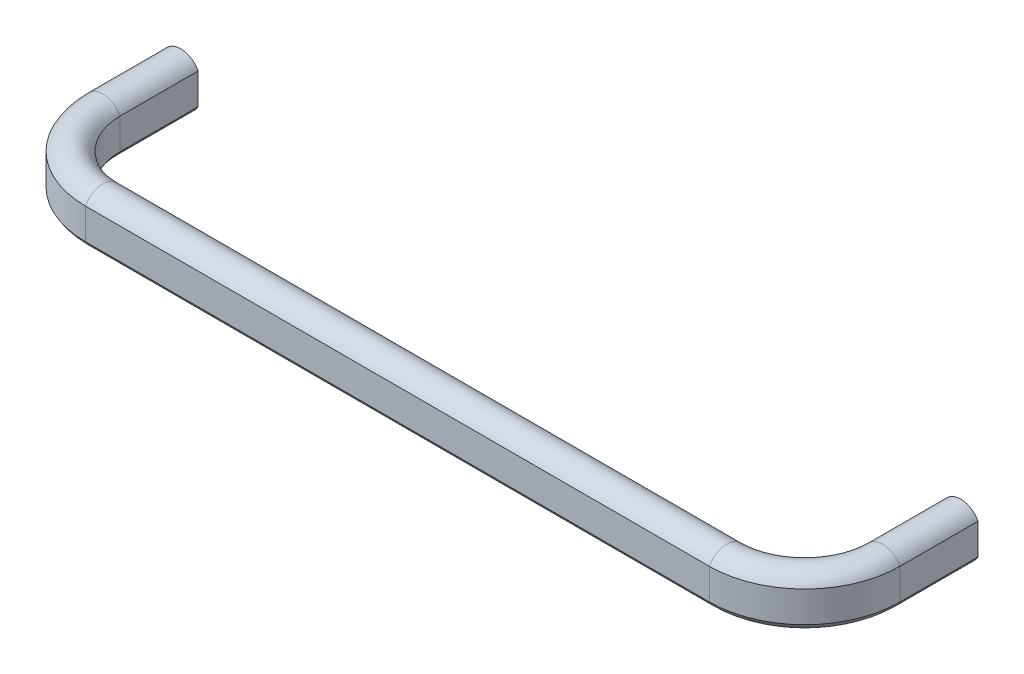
ISO-10303-21;
HEADER;
FILE_DESCRIPTION(('STEP AP214'),'2;1');
FILE_NAME('part.step','',(''),(''),'','','');
FILE_SCHEMA(('AUTOMOTIVE_DESIGN { 1 0 10303 214 1 1 1 1 }'));
ENDSEC;
DATA;
#1=APPLICATION_CONTEXT('core data for automotive mechanical design processes');
#2=APPLICATION_PROTOCOL_DEFINITION('international standard','automotive_design',2000,#1);
#3=PRODUCT_CONTEXT('',#1,'mechanical');
#4=PRODUCT('Part','Part','',(#3));
#5=PRODUCT_RELATED_PRODUCT_CATEGORY('part','',(#4));
#6=PRODUCT_DEFINITION_FORMATION('','',#4);
#7=PRODUCT_DEFINITION_CONTEXT('part definition',#1,'design');
#8=PRODUCT_DEFINITION('design','',#6,#7);
#9=PRODUCT_DEFINITION_SHAPE('','',#8);
#10=(LENGTH_UNIT() NAMED_UNIT(*) SI_UNIT(.MILLI.,.METRE.));
#11=(NAMED_UNIT(*) PLANE_ANGLE_UNIT() SI_UNIT($,.RADIAN.));
#12=(NAMED_UNIT(*) SI_UNIT($,.STERADIAN.) SOLID_ANGLE_UNIT());
#13=UNCERTAINTY_MEASURE_WITH_UNIT(LENGTH_MEASURE(1.E-05),#10,'distance_accuracy_value','');
#14=(GEOMETRIC_REPRESENTATION_CONTEXT(3) GLOBAL_UNCERTAINTY_ASSIGNED_CONTEXT((#13)) GLOBAL_UNIT_ASSIGNED_CONTEXT((#10,
#11,#12)) REPRESENTATION_CONTEXT('',''));
#15=CARTESIAN_POINT('',(0.,0.,0.));
#16=DIRECTION('',(0.,0.,1.));
#17=DIRECTION('',(1.,0.,0.));
#18=AXIS2_PLACEMENT_3D('',#15,#16,#17);
#19=CARTESIAN_POINT('',(179.999999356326,1.50000021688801,0.));
#20=DIRECTION('',(0.,0.,1.));
#21=DIRECTION('',(0.,1.,0.));
#22=AXIS2_PLACEMENT_3D('',#19,#20,#21);
#23=PLANE('',#22);
#24=CARTESIAN_POINT('',(180.,0.,0.));
#25=DIRECTION('',(0.,0.,1.));
#26=DIRECTION('',(1.,0.,0.));
#27=AXIS2_PLACEMENT_3D('',#24,#25,#26);
#28=CIRCLE('',#27,2.95000000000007);
#29=CARTESIAN_POINT('',(182.95,0.,0.));
#30=VERTEX_POINT('',#29);
#31=EDGE_CURVE('E9',#30,#30,#28,.T.);
#32=ORIENTED_EDGE('',*,*,#31,.T.);
#33=EDGE_LOOP('',(#32));
#34=FACE_BOUND('',#33,.T.);
#35=CARTESIAN_POINT('',(179.999999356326,1.50000021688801,0.));
#36=DIRECTION('',(0.,0.,1.));
#37=DIRECTION('',(0.,1.,0.));
#38=AXIS2_PLACEMENT_3D('',#35,#36,#37);
#39=CIRCLE('',#38,4.50000072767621);
#40=CARTESIAN_POINT('',(184.000000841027,3.56155173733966,0.));
#41=VERTEX_POINT('',#40);
#42=CARTESIAN_POINT('',(175.999999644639,3.56155517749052,0.));
#43=VERTEX_POINT('',#42);
#44=EDGE_CURVE('E209',#41,#43,#39,.T.);
#45=ORIENTED_EDGE('',*,*,#44,.F.);
#46=DIRECTION('',(-2.36140868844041E-07,-0.999999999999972,0.));
#47=VECTOR('',#46,1.);
#48=CARTESIAN_POINT('',(184.000000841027,3.56155173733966,0.));
#49=LINE('',#48,#47);
#50=CARTESIAN_POINT('',(183.999999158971,-3.56155311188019,0.));
#51=VERTEX_POINT('',#50);
#52=EDGE_CURVE('E30',#41,#51,#49,.T.);
#53=ORIENTED_EDGE('',*,*,#52,.T.);
#54=CARTESIAN_POINT('',(179.99999767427,-1.50000159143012,0.));
#55=DIRECTION('',(0.,0.,1.));
#56=DIRECTION('',(0.,1.,0.));
#57=AXIS2_PLACEMENT_3D('',#54,#55,#56);
#58=CIRCLE('',#57,4.49999811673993);
#59=CARTESIAN_POINT('',(176.000000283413,-3.56155535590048,0.));
#60=VERTEX_POINT('',#59);
#61=EDGE_CURVE('E38',#60,#51,#58,.T.);
#62=ORIENTED_EDGE('',*,*,#61,.F.);
#63=DIRECTION('',(-2.36140868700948E-07,-0.999999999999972,0.));
#64=VECTOR('',#63,1.);
#65=CARTESIAN_POINT('',(175.999999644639,3.56155517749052,0.));
#66=LINE('',#65,#64);
#67=EDGE_CURVE('E230',#43,#60,#66,.T.);
#68=ORIENTED_EDGE('',*,*,#67,.F.);
#69=EDGE_LOOP('',(#45,#53,#62,#68));
#70=FACE_BOUND('',#69,.T.);
#71=ADVANCED_FACE('F14',(#34,#70),#23,.F.);
#72=CARTESIAN_POINT('',(6.43673064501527E-07,1.50000021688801,0.));
#73=DIRECTION('',(0.,0.,-1.));
#74=DIRECTION('',(0.,1.,0.));
#75=AXIS2_PLACEMENT_3D('',#72,#73,#74);
#76=PLANE('',#75);
#77=CARTESIAN_POINT('',(0.,0.,0.));
#78=DIRECTION('',(0.,0.,-1.));
#79=DIRECTION('',(-1.,0.,0.));
#80=AXIS2_PLACEMENT_3D('',#77,#78,#79);
#81=CIRCLE('',#80,2.95);
#82=CARTESIAN_POINT('',(-2.95,0.,0.));
#83=VERTEX_POINT('',#82);
#84=EDGE_CURVE('E236',#83,#83,#81,.F.);
#85=ORIENTED_EDGE('',*,*,#84,.T.);
#86=EDGE_LOOP('',(#85));
#87=FACE_BOUND('',#86,.T.);
#88=CARTESIAN_POINT('',(6.43673064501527E-07,1.50000021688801,0.));
#89=DIRECTION('',(0.,0.,-1.));
#90=DIRECTION('',(0.,1.,0.));
#91=AXIS2_PLACEMENT_3D('',#88,#89,#90);
#92=CIRCLE('',#91,4.50000072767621);
#93=CARTESIAN_POINT('',(-4.00000084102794,3.56155173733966,0.));
#94=VERTEX_POINT('',#93);
#95=CARTESIAN_POINT('',(4.00000035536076,3.56155517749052,0.));
#96=VERTEX_POINT('',#95);
#97=EDGE_CURVE('E107',#94,#96,#92,.T.);
#98=ORIENTED_EDGE('',*,*,#97,.T.);
#99=DIRECTION('',(2.36140868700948E-07,-0.999999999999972,0.));
#100=VECTOR('',#99,1.);
#101=CARTESIAN_POINT('',(4.00000035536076,3.56155517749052,0.));
#102=LINE('',#101,#100);
#103=CARTESIAN_POINT('',(3.99999971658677,-3.56155535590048,0.));
#104=VERTEX_POINT('',#103);
#105=EDGE_CURVE('E111',#96,#104,#102,.T.);
#106=ORIENTED_EDGE('',*,*,#105,.T.);
#107=CARTESIAN_POINT('',(2.32573006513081E-06,-1.50000159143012,0.));
#108=DIRECTION('',(0.,0.,-1.));
#109=DIRECTION('',(0.,1.,0.));
#110=AXIS2_PLACEMENT_3D('',#107,#108,#109);
#111=CIRCLE('',#110,4.49999811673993);
#112=CARTESIAN_POINT('',(-3.99999915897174,-3.56155311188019,0.));
#113=VERTEX_POINT('',#112);
#114=EDGE_CURVE('E132',#104,#113,#111,.T.);
#115=ORIENTED_EDGE('',*,*,#114,.T.);
#116=DIRECTION('',(2.36140868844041E-07,-0.999999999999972,0.));
#117=VECTOR('',#116,1.);
#118=CARTESIAN_POINT('',(-4.00000084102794,3.56155173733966,0.));
#119=LINE('',#118,#117);
#120=EDGE_CURVE('E114',#94,#113,#119,.T.);
#121=ORIENTED_EDGE('',*,*,#120,.F.);
#122=EDGE_LOOP('',(#98,#106,#115,#121));
#123=FACE_BOUND('',#122,.T.);
#124=ADVANCED_FACE('F109',(#87,#123),#76,.T.);
#125=CARTESIAN_POINT('',(184.000000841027,3.56155173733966,18.));
#126=DIRECTION('',(0.999999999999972,-2.36140868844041E-07,0.));
#127=DIRECTION('',(2.36140868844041E-07,0.999999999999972,0.));
#128=AXIS2_PLACEMENT_3D('',#125,#126,#127);
#129=PLANE('',#128);
#130=DIRECTION('',(-2.36140868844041E-07,-0.999999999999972,0.));
#131=VECTOR('',#130,1.);
#132=CARTESIAN_POINT('',(184.000000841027,3.56155173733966,18.));
#133=LINE('',#132,#131);
#134=CARTESIAN_POINT('',(184.000000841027,3.56155173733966,18.));
#135=VERTEX_POINT('',#134);
#136=CARTESIAN_POINT('',(183.999999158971,-3.56155311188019,18.));
#137=VERTEX_POINT('',#136);
#138=EDGE_CURVE('E200',#135,#137,#133,.T.);
#139=ORIENTED_EDGE('',*,*,#138,.T.);
#140=DIRECTION('',(0.,0.,-1.));
#141=VECTOR('',#140,1.);
#142=CARTESIAN_POINT('',(183.999999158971,-3.56155311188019,18.));
#143=LINE('',#142,#141);
#144=EDGE_CURVE('E223',#137,#51,#143,.T.);
#145=ORIENTED_EDGE('',*,*,#144,.T.);
#146=ORIENTED_EDGE('',*,*,#52,.F.);
#147=DIRECTION('',(0.,0.,-1.));
#148=VECTOR('',#147,1.);
#149=CARTESIAN_POINT('',(184.000000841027,3.56155173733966,18.));
#150=LINE('',#149,#148);
#151=EDGE_CURVE('E225',#135,#41,#150,.T.);
#152=ORIENTED_EDGE('',*,*,#151,.F.);
#153=EDGE_LOOP('',(#139,#145,#146,#152));
#154=FACE_BOUND('',#153,.T.);
#155=ADVANCED_FACE('F262',(#154),#129,.T.);
#156=CARTESIAN_POINT('',(179.99999767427,-1.50000159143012,18.));
#157=DIRECTION('',(0.,0.,-1.));
#158=DIRECTION('',(1.,0.,0.));
#159=AXIS2_PLACEMENT_3D('',#156,#157,#158);
#160=CYLINDRICAL_SURFACE('',#159,4.49999811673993);
#161=CARTESIAN_POINT('',(179.99999767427,-1.50000159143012,18.));
#162=DIRECTION('',(0.,0.,1.));
#163=DIRECTION('',(0.,1.,0.));
#164=AXIS2_PLACEMENT_3D('',#161,#162,#163);
#165=CIRCLE('',#164,4.49999811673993);
#166=CARTESIAN_POINT('',(176.000000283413,-3.56155535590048,18.));
#167=VERTEX_POINT('',#166);
#168=EDGE_CURVE('E214',#167,#137,#165,.T.);
#169=ORIENTED_EDGE('',*,*,#168,.F.);
#170=DIRECTION('',(0.,0.,-1.));
#171=VECTOR('',#170,1.);
#172=CARTESIAN_POINT('',(176.000000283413,-3.56155535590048,18.));
#173=LINE('',#172,#171);
#174=EDGE_CURVE('E221',#167,#60,#173,.T.);
#175=ORIENTED_EDGE('',*,*,#174,.T.);
#176=ORIENTED_EDGE('',*,*,#61,.T.);
#177=ORIENTED_EDGE('',*,*,#144,.F.);
#178=EDGE_LOOP('',(#169,#175,#176,#177));
#179=FACE_BOUND('',#178,.T.);
#180=ADVANCED_FACE('F336',(#179),#160,.T.);
#181=CARTESIAN_POINT('',(175.999999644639,3.56155517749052,18.));
#182=DIRECTION('',(0.999999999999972,-2.36140868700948E-07,0.));
#183=DIRECTION('',(2.36140868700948E-07,0.999999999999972,0.));
#184=AXIS2_PLACEMENT_3D('',#181,#182,#183);
#185=PLANE('',#184);
#186=DIRECTION('',(-2.36140868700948E-07,-0.999999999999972,0.));
#187=VECTOR('',#186,1.);
#188=CARTESIAN_POINT('',(175.999999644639,3.56155517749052,18.));
#189=LINE('',#188,#187);
#190=CARTESIAN_POINT('',(175.999999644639,3.56155517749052,18.));
#191=VERTEX_POINT('',#190);
#192=EDGE_CURVE('E211',#191,#167,#189,.T.);
#193=ORIENTED_EDGE('',*,*,#192,.F.);
#194=DIRECTION('',(0.,0.,-1.));
#195=VECTOR('',#194,1.);
#196=CARTESIAN_POINT('',(175.999999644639,3.56155517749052,18.));
#197=LINE('',#196,#195);
#198=EDGE_CURVE('E218',#191,#43,#197,.T.);
#199=ORIENTED_EDGE('',*,*,#198,.T.);
#200=ORIENTED_EDGE('',*,*,#67,.T.);
#201=ORIENTED_EDGE('',*,*,#174,.F.);
#202=EDGE_LOOP('',(#193,#199,#200,#201));
#203=FACE_BOUND('',#202,.T.);
#204=ADVANCED_FACE('F332',(#203),#185,.F.);
#205=CARTESIAN_POINT('',(179.999999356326,1.50000021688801,18.));
#206=DIRECTION('',(0.,0.,-1.));
#207=DIRECTION('',(1.,0.,0.));
#208=AXIS2_PLACEMENT_3D('',#205,#206,#207);
#209=CYLINDRICAL_SURFACE('',#208,4.50000072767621);
#210=CARTESIAN_POINT('',(179.999999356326,1.50000021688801,18.));
#211=DIRECTION('',(0.,0.,1.));
#212=DIRECTION('',(0.,1.,0.));
#213=AXIS2_PLACEMENT_3D('',#210,#211,#212);
#214=CIRCLE('',#213,4.50000072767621);
#215=EDGE_CURVE('E187',#135,#191,#214,.T.);
#216=ORIENTED_EDGE('',*,*,#215,.F.);
#217=ORIENTED_EDGE('',*,*,#151,.T.);
#218=ORIENTED_EDGE('',*,*,#44,.T.);
#219=ORIENTED_EDGE('',*,*,#198,.F.);
#220=EDGE_LOOP('',(#216,#217,#218,#219));
#221=FACE_BOUND('',#220,.T.);
#222=ADVANCED_FACE('F328',(#221),#209,.T.);
#223=CARTESIAN_POINT('',(162.,9.44564039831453E-07,18.));
#224=DIRECTION('',(0.,1.,0.));
#225=DIRECTION('',(-1.,0.,0.));
#226=AXIS2_PLACEMENT_3D('',#223,#224,#225);
#227=CYLINDRICAL_SURFACE('',#226,21.9999999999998);
#228=DIRECTION('',(0.,-0.999999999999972,-2.36140868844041E-07));
#229=VECTOR('',#228,1.);
#230=CARTESIAN_POINT('',(162.,3.56155173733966,40.0000008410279));
#231=LINE('',#230,#229);
#232=CARTESIAN_POINT('',(162.,3.56155173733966,40.0000008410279));
#233=VERTEX_POINT('',#232);
#234=CARTESIAN_POINT('',(162.,-3.56155311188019,39.9999991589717));
#235=VERTEX_POINT('',#234);
#236=EDGE_CURVE('E178',#233,#235,#231,.T.);
#237=ORIENTED_EDGE('',*,*,#236,.T.);
#238=CARTESIAN_POINT('',(162.,-3.56155311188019,18.));
#239=DIRECTION('',(0.,1.,0.));
#240=DIRECTION('',(-1.,0.,0.));
#241=AXIS2_PLACEMENT_3D('',#238,#239,#240);
#242=CIRCLE('',#241,21.9999991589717);
#243=EDGE_CURVE('E203',#235,#137,#242,.T.);
#244=ORIENTED_EDGE('',*,*,#243,.T.);
#245=ORIENTED_EDGE('',*,*,#138,.F.);
#246=CARTESIAN_POINT('',(162.,3.56155173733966,18.));
#247=DIRECTION('',(0.,1.,0.));
#248=DIRECTION('',(-1.,0.,0.));
#249=AXIS2_PLACEMENT_3D('',#246,#247,#248);
#250=CIRCLE('',#249,22.0000008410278);
#251=EDGE_CURVE('E206',#233,#135,#250,.T.);
#252=ORIENTED_EDGE('',*,*,#251,.F.);
#253=EDGE_LOOP('',(#237,#244,#245,#252));
#254=FACE_BOUND('',#253,.T.);
#255=ADVANCED_FACE('F324',(#254),#227,.T.);
#256=CARTESIAN_POINT('',(162.,-1.50000159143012,18.));
#257=DIRECTION('',(0.,1.,0.));
#258=DIRECTION('',(-1.,0.,0.));
#259=AXIS2_PLACEMENT_3D('',#256,#257,#258);
#260=TOROIDAL_SURFACE('',#259,17.9999976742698,4.49999811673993);
#261=CARTESIAN_POINT('',(162.,-1.50000159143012,35.9999976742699));
#262=DIRECTION('',(-1.,0.,0.));
#263=DIRECTION('',(0.,1.,0.));
#264=AXIS2_PLACEMENT_3D('',#261,#262,#263);
#265=CIRCLE('',#264,4.49999811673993);
#266=CARTESIAN_POINT('',(162.,-3.56155535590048,32.0000002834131));
#267=VERTEX_POINT('',#266);
#268=EDGE_CURVE('E192',#267,#235,#265,.T.);
#269=ORIENTED_EDGE('',*,*,#268,.F.);
#270=CARTESIAN_POINT('',(162.,-3.56155535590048,18.));
#271=DIRECTION('',(0.,1.,0.));
#272=DIRECTION('',(-1.,0.,0.));
#273=AXIS2_PLACEMENT_3D('',#270,#271,#272);
#274=CIRCLE('',#273,14.0000002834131);
#275=EDGE_CURVE('E199',#267,#167,#274,.T.);
#276=ORIENTED_EDGE('',*,*,#275,.T.);
#277=ORIENTED_EDGE('',*,*,#168,.T.);
#278=ORIENTED_EDGE('',*,*,#243,.F.);
#279=EDGE_LOOP('',(#269,#276,#277,#278));
#280=FACE_BOUND('',#279,.T.);
#281=ADVANCED_FACE('F320',(#280),#260,.T.);
#282=CARTESIAN_POINT('',(162.,9.44564039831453E-07,18.));
#283=DIRECTION('',(0.,1.,0.));
#284=DIRECTION('',(-1.,0.,0.));
#285=AXIS2_PLACEMENT_3D('',#282,#283,#284);
#286=CYLINDRICAL_SURFACE('',#285,13.9999999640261);
#287=DIRECTION('',(0.,-0.999999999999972,-2.36140868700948E-07));
#288=VECTOR('',#287,1.);
#289=CARTESIAN_POINT('',(162.,3.56155517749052,31.9999996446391));
#290=LINE('',#289,#288);
#291=CARTESIAN_POINT('',(162.,3.56155517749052,31.9999996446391));
#292=VERTEX_POINT('',#291);
#293=EDGE_CURVE('E189',#292,#267,#290,.T.);
#294=ORIENTED_EDGE('',*,*,#293,.F.);
#295=CARTESIAN_POINT('',(162.,3.56155517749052,18.));
#296=DIRECTION('',(0.,1.,0.));
#297=DIRECTION('',(-1.,0.,0.));
#298=AXIS2_PLACEMENT_3D('',#295,#296,#297);
#299=CIRCLE('',#298,13.9999996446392);
#300=EDGE_CURVE('E196',#292,#191,#299,.T.);
#301=ORIENTED_EDGE('',*,*,#300,.T.);
#302=ORIENTED_EDGE('',*,*,#192,.T.);
#303=ORIENTED_EDGE('',*,*,#275,.F.);
#304=EDGE_LOOP('',(#294,#301,#302,#303));
#305=FACE_BOUND('',#304,.T.);
#306=ADVANCED_FACE('F316',(#305),#286,.F.);
#307=CARTESIAN_POINT('',(162.,1.50000021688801,18.));
#308=DIRECTION('',(0.,1.,0.));
#309=DIRECTION('',(-1.,0.,0.));
#310=AXIS2_PLACEMENT_3D('',#307,#308,#309);
#311=TOROIDAL_SURFACE('',#310,17.9999993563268,4.50000072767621);
#312=CARTESIAN_POINT('',(162.,1.50000021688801,35.9999993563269));
#313=DIRECTION('',(-1.,0.,0.));
#314=DIRECTION('',(0.,1.,0.));
#315=AXIS2_PLACEMENT_3D('',#312,#313,#314);
#316=CIRCLE('',#315,4.50000072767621);
#317=EDGE_CURVE('E165',#233,#292,#316,.T.);
#318=ORIENTED_EDGE('',*,*,#317,.F.);
#319=ORIENTED_EDGE('',*,*,#251,.T.);
#320=ORIENTED_EDGE('',*,*,#215,.T.);
#321=ORIENTED_EDGE('',*,*,#300,.F.);
#322=EDGE_LOOP('',(#318,#319,#320,#321));
#323=FACE_BOUND('',#322,.T.);
#324=ADVANCED_FACE('F312',(#323),#311,.T.);
#325=CARTESIAN_POINT('',(18.,3.56155173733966,40.0000008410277));
#326=DIRECTION('',(0.,-2.36140868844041E-07,0.999999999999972));
#327=DIRECTION('',(0.,-0.999999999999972,-2.36140868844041E-07));
#328=AXIS2_PLACEMENT_3D('',#325,#326,#327);
#329=PLANE('',#328);
#330=DIRECTION('',(0.,-0.999999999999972,-2.36140868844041E-07));
#331=VECTOR('',#330,1.);
#332=CARTESIAN_POINT('',(18.,3.56155173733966,40.0000008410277));
#333=LINE('',#332,#331);
#334=CARTESIAN_POINT('',(18.,3.56155173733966,40.0000008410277));
#335=VERTEX_POINT('',#334);
#336=CARTESIAN_POINT('',(18.,-3.56155311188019,39.9999991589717));
#337=VERTEX_POINT('',#336);
#338=EDGE_CURVE('E156',#335,#337,#333,.T.);
#339=ORIENTED_EDGE('',*,*,#338,.T.);
#340=DIRECTION('',(1.,0.,0.));
#341=VECTOR('',#340,1.);
#342=CARTESIAN_POINT('',(18.,-3.56155311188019,39.9999991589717));
#343=LINE('',#342,#341);
#344=EDGE_CURVE('E181',#337,#235,#343,.T.);
#345=ORIENTED_EDGE('',*,*,#344,.T.);
#346=ORIENTED_EDGE('',*,*,#236,.F.);
#347=DIRECTION('',(1.,0.,0.));
#348=VECTOR('',#347,1.);
#349=CARTESIAN_POINT('',(18.,3.56155173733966,40.0000008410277));
#350=LINE('',#349,#348);
#351=EDGE_CURVE('E184',#335,#233,#350,.T.);
#352=ORIENTED_EDGE('',*,*,#351,.F.);
#353=EDGE_LOOP('',(#339,#345,#346,#352));
#354=FACE_BOUND('',#353,.T.);
#355=ADVANCED_FACE('F308',(#354),#329,.T.);
#356=CARTESIAN_POINT('',(18.,-1.50000159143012,35.9999976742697));
#357=DIRECTION('',(1.,0.,0.));
#358=DIRECTION('',(0.,0.,1.));
#359=AXIS2_PLACEMENT_3D('',#356,#357,#358);
#360=CYLINDRICAL_SURFACE('',#359,4.49999811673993);
#361=CARTESIAN_POINT('',(18.,-1.50000159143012,35.9999976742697));
#362=DIRECTION('',(-1.,0.,0.));
#363=DIRECTION('',(0.,1.,0.));
#364=AXIS2_PLACEMENT_3D('',#361,#362,#363);
#365=CIRCLE('',#364,4.49999811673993);
#366=CARTESIAN_POINT('',(18.,-3.56155535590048,32.0000002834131));
#367=VERTEX_POINT('',#366);
#368=EDGE_CURVE('E170',#367,#337,#365,.T.);
#369=ORIENTED_EDGE('',*,*,#368,.F.);
#370=DIRECTION('',(1.,0.,0.));
#371=VECTOR('',#370,1.);
#372=CARTESIAN_POINT('',(18.,-3.56155535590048,32.0000002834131));
#373=LINE('',#372,#371);
#374=EDGE_CURVE('E177',#367,#267,#373,.T.);
#375=ORIENTED_EDGE('',*,*,#374,.T.);
#376=ORIENTED_EDGE('',*,*,#268,.T.);
#377=ORIENTED_EDGE('',*,*,#344,.F.);
#378=EDGE_LOOP('',(#369,#375,#376,#377));
#379=FACE_BOUND('',#378,.T.);
#380=ADVANCED_FACE('F304',(#379),#360,.T.);
#381=CARTESIAN_POINT('',(18.,3.56155517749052,31.9999996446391));
#382=DIRECTION('',(0.,-2.36140868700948E-07,0.999999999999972));
#383=DIRECTION('',(0.,-0.999999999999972,-2.36140868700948E-07));
#384=AXIS2_PLACEMENT_3D('',#381,#382,#383);
#385=PLANE('',#384);
#386=DIRECTION('',(0.,-0.999999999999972,-2.36140868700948E-07));
#387=VECTOR('',#386,1.);
#388=CARTESIAN_POINT('',(18.,3.56155517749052,31.9999996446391));
#389=LINE('',#388,#387);
#390=CARTESIAN_POINT('',(18.,3.56155517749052,31.9999996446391));
#391=VERTEX_POINT('',#390);
#392=EDGE_CURVE('E167',#391,#367,#389,.T.);
#393=ORIENTED_EDGE('',*,*,#392,.F.);
#394=DIRECTION('',(1.,0.,0.));
#395=VECTOR('',#394,1.);
#396=CARTESIAN_POINT('',(18.,3.56155517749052,31.9999996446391));
#397=LINE('',#396,#395);
#398=EDGE_CURVE('E174',#391,#292,#397,.T.);
#399=ORIENTED_EDGE('',*,*,#398,.T.);
#400=ORIENTED_EDGE('',*,*,#293,.T.);
#401=ORIENTED_EDGE('',*,*,#374,.F.);
#402=EDGE_LOOP('',(#393,#399,#400,#401));
#403=FACE_BOUND('',#402,.T.);
#404=ADVANCED_FACE('F300',(#403),#385,.F.);
#405=CARTESIAN_POINT('',(18.,1.50000021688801,35.9999993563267));
#406=DIRECTION('',(1.,0.,0.));
#407=DIRECTION('',(0.,0.,1.));
#408=AXIS2_PLACEMENT_3D('',#405,#406,#407);
#409=CYLINDRICAL_SURFACE('',#408,4.50000072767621);
#410=CARTESIAN_POINT('',(18.,1.50000021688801,35.9999993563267));
#411=DIRECTION('',(-1.,0.,0.));
#412=DIRECTION('',(0.,1.,0.));
#413=AXIS2_PLACEMENT_3D('',#410,#411,#412);
#414=CIRCLE('',#413,4.50000072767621);
#415=EDGE_CURVE('E151',#335,#391,#414,.T.);
#416=ORIENTED_EDGE('',*,*,#415,.F.);
#417=ORIENTED_EDGE('',*,*,#351,.T.);
#418=ORIENTED_EDGE('',*,*,#317,.T.);
#419=ORIENTED_EDGE('',*,*,#398,.F.);
#420=EDGE_LOOP('',(#416,#417,#418,#419));
#421=FACE_BOUND('',#420,.T.);
#422=ADVANCED_FACE('F296',(#421),#409,.T.);
#423=CARTESIAN_POINT('',(18.,9.44564039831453E-07,18.));
#424=DIRECTION('',(0.,1.,0.));
#425=DIRECTION('',(-1.,0.,0.));
#426=AXIS2_PLACEMENT_3D('',#423,#424,#425);
#427=CYLINDRICAL_SURFACE('',#426,21.9999999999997);
#428=DIRECTION('',(2.36140868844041E-07,-0.999999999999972,0.));
#429=VECTOR('',#428,1.);
#430=CARTESIAN_POINT('',(-4.00000084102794,3.56155173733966,18.));
#431=LINE('',#430,#429);
#432=CARTESIAN_POINT('',(-4.00000084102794,3.56155173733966,18.));
#433=VERTEX_POINT('',#432);
#434=CARTESIAN_POINT('',(-3.99999915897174,-3.56155311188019,18.));
#435=VERTEX_POINT('',#434);
#436=EDGE_CURVE('E128',#433,#435,#431,.T.);
#437=ORIENTED_EDGE('',*,*,#436,.T.);
#438=CARTESIAN_POINT('',(18.,-3.56155311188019,18.));
#439=DIRECTION('',(0.,1.,0.));
#440=DIRECTION('',(-1.,0.,0.));
#441=AXIS2_PLACEMENT_3D('',#438,#439,#440);
#442=CIRCLE('',#441,21.9999991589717);
#443=EDGE_CURVE('E159',#435,#337,#442,.T.);
#444=ORIENTED_EDGE('',*,*,#443,.T.);
#445=ORIENTED_EDGE('',*,*,#338,.F.);
#446=CARTESIAN_POINT('',(18.,3.56155173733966,18.));
#447=DIRECTION('',(0.,1.,0.));
#448=DIRECTION('',(-1.,0.,0.));
#449=AXIS2_PLACEMENT_3D('',#446,#447,#448);
#450=CIRCLE('',#449,22.0000008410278);
#451=EDGE_CURVE('E162',#433,#335,#450,.T.);
#452=ORIENTED_EDGE('',*,*,#451,.F.);
#453=EDGE_LOOP('',(#437,#444,#445,#452));
#454=FACE_BOUND('',#453,.T.);
#455=ADVANCED_FACE('F292',(#454),#427,.T.);
#456=CARTESIAN_POINT('',(18.,-1.50000159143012,18.));
#457=DIRECTION('',(0.,1.,0.));
#458=DIRECTION('',(-1.,0.,0.));
#459=AXIS2_PLACEMENT_3D('',#456,#457,#458);
#460=TOROIDAL_SURFACE('',#459,17.9999976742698,4.49999811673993);
#461=CARTESIAN_POINT('',(2.32573006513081E-06,-1.50000159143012,18.));
#462=DIRECTION('',(0.,0.,-1.));
#463=DIRECTION('',(0.,1.,0.));
#464=AXIS2_PLACEMENT_3D('',#461,#462,#463);
#465=CIRCLE('',#464,4.49999811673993);
#466=CARTESIAN_POINT('',(3.99999971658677,-3.56155535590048,18.));
#467=VERTEX_POINT('',#466);
#468=EDGE_CURVE('E141',#467,#435,#465,.T.);
#469=ORIENTED_EDGE('',*,*,#468,.F.);
#470=CARTESIAN_POINT('',(18.,-3.56155535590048,18.));
#471=DIRECTION('',(0.,1.,0.));
#472=DIRECTION('',(-1.,0.,0.));
#473=AXIS2_PLACEMENT_3D('',#470,#471,#472);
#474=CIRCLE('',#473,14.0000002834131);
#475=EDGE_CURVE('E155',#467,#367,#474,.T.);
#476=ORIENTED_EDGE('',*,*,#475,.T.);
#477=ORIENTED_EDGE('',*,*,#368,.T.);
#478=ORIENTED_EDGE('',*,*,#443,.F.);
#479=EDGE_LOOP('',(#469,#476,#477,#478));
#480=FACE_BOUND('',#479,.T.);
#481=ADVANCED_FACE('F288',(#480),#460,.T.);
#482=CARTESIAN_POINT('',(18.,9.44564039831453E-07,18.));
#483=DIRECTION('',(0.,1.,0.));
#484=DIRECTION('',(-1.,0.,0.));
#485=AXIS2_PLACEMENT_3D('',#482,#483,#484);
#486=CYLINDRICAL_SURFACE('',#485,13.9999999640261);
#487=DIRECTION('',(2.36140868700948E-07,-0.999999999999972,0.));
#488=VECTOR('',#487,1.);
#489=CARTESIAN_POINT('',(4.00000035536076,3.56155517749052,18.));
#490=LINE('',#489,#488);
#491=CARTESIAN_POINT('',(4.00000035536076,3.56155517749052,18.));
#492=VERTEX_POINT('',#491);
#493=EDGE_CURVE('E139',#492,#467,#490,.T.);
#494=ORIENTED_EDGE('',*,*,#493,.F.);
#495=CARTESIAN_POINT('',(18.,3.56155517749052,18.));
#496=DIRECTION('',(0.,1.,0.));
#497=DIRECTION('',(-1.,0.,0.));
#498=AXIS2_PLACEMENT_3D('',#495,#496,#497);
#499=CIRCLE('',#498,13.9999996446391);
#500=EDGE_CURVE('E152',#492,#391,#499,.T.);
#501=ORIENTED_EDGE('',*,*,#500,.T.);
#502=ORIENTED_EDGE('',*,*,#392,.T.);
#503=ORIENTED_EDGE('',*,*,#475,.F.);
#504=EDGE_LOOP('',(#494,#501,#502,#503));
#505=FACE_BOUND('',#504,.T.);
#506=ADVANCED_FACE('F284',(#505),#486,.F.);
#507=CARTESIAN_POINT('',(18.,1.50000021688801,18.));
#508=DIRECTION('',(0.,1.,0.));
#509=DIRECTION('',(-1.,0.,0.));
#510=AXIS2_PLACEMENT_3D('',#507,#508,#509);
#511=TOROIDAL_SURFACE('',#510,17.9999993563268,4.50000072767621);
#512=CARTESIAN_POINT('',(6.43673064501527E-07,1.50000021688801,18.));
#513=DIRECTION('',(0.,0.,-1.));
#514=DIRECTION('',(0.,1.,0.));
#515=AXIS2_PLACEMENT_3D('',#512,#513,#514);
#516=CIRCLE('',#515,4.50000072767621);
#517=EDGE_CURVE('E123',#433,#492,#516,.T.);
#518=ORIENTED_EDGE('',*,*,#517,.F.);
#519=ORIENTED_EDGE('',*,*,#451,.T.);
#520=ORIENTED_EDGE('',*,*,#415,.T.);
#521=ORIENTED_EDGE('',*,*,#500,.F.);
#522=EDGE_LOOP('',(#518,#519,#520,#521));
#523=FACE_BOUND('',#522,.T.);
#524=ADVANCED_FACE('F280',(#523),#511,.T.);
#525=CARTESIAN_POINT('',(-4.00000084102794,3.56155173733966,18.));
#526=DIRECTION('',(0.999999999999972,2.36140868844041E-07,0.));
#527=DIRECTION('',(-2.36140868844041E-07,0.999999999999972,0.));
#528=AXIS2_PLACEMENT_3D('',#525,#526,#527);
#529=PLANE('',#528);
#530=DIRECTION('',(0.,0.,-1.));
#531=VECTOR('',#530,1.);
#532=CARTESIAN_POINT('',(-3.99999915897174,-3.56155311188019,18.));
#533=LINE('',#532,#531);
#534=EDGE_CURVE('E146',#435,#113,#533,.T.);
#535=ORIENTED_EDGE('',*,*,#534,.F.);
#536=ORIENTED_EDGE('',*,*,#436,.F.);
#537=DIRECTION('',(0.,0.,-1.));
#538=VECTOR('',#537,1.);
#539=CARTESIAN_POINT('',(-4.00000084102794,3.56155173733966,18.));
#540=LINE('',#539,#538);
#541=EDGE_CURVE('E149',#433,#94,#540,.T.);
#542=ORIENTED_EDGE('',*,*,#541,.T.);
#543=ORIENTED_EDGE('',*,*,#120,.T.);
#544=EDGE_LOOP('',(#535,#536,#542,#543));
#545=FACE_BOUND('',#544,.T.);
#546=ADVANCED_FACE('F276',(#545),#529,.F.);
#547=CARTESIAN_POINT('',(2.32573006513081E-06,-1.50000159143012,18.));
#548=DIRECTION('',(0.,0.,-1.));
#549=DIRECTION('',(0.,1.,0.));
#550=AXIS2_PLACEMENT_3D('',#547,#548,#549);
#551=CYLINDRICAL_SURFACE('',#550,4.49999811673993);
#552=DIRECTION('',(0.,0.,-1.));
#553=VECTOR('',#552,1.);
#554=CARTESIAN_POINT('',(3.99999971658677,-3.56155535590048,18.));
#555=LINE('',#554,#553);
#556=EDGE_CURVE('E127',#467,#104,#555,.T.);
#557=ORIENTED_EDGE('',*,*,#556,.F.);
#558=ORIENTED_EDGE('',*,*,#468,.T.);
#559=ORIENTED_EDGE('',*,*,#534,.T.);
#560=ORIENTED_EDGE('',*,*,#114,.F.);
#561=EDGE_LOOP('',(#557,#558,#559,#560));
#562=FACE_BOUND('',#561,.T.);
#563=ADVANCED_FACE('F273',(#562),#551,.T.);
#564=CARTESIAN_POINT('',(4.00000035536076,3.56155517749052,18.));
#565=DIRECTION('',(0.999999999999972,2.36140868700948E-07,0.));
#566=DIRECTION('',(-2.36140868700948E-07,0.999999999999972,0.));
#567=AXIS2_PLACEMENT_3D('',#564,#565,#566);
#568=PLANE('',#567);
#569=DIRECTION('',(0.,0.,-1.));
#570=VECTOR('',#569,1.);
#571=CARTESIAN_POINT('',(4.00000035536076,3.56155517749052,18.));
#572=LINE('',#571,#570);
#573=EDGE_CURVE('E120',#492,#96,#572,.T.);
#574=ORIENTED_EDGE('',*,*,#573,.F.);
#575=ORIENTED_EDGE('',*,*,#493,.T.);
#576=ORIENTED_EDGE('',*,*,#556,.T.);
#577=ORIENTED_EDGE('',*,*,#105,.F.);
#578=EDGE_LOOP('',(#574,#575,#576,#577));
#579=FACE_BOUND('',#578,.T.);
#580=ADVANCED_FACE('F130',(#579),#568,.T.);
#581=CARTESIAN_POINT('',(6.43673064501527E-07,1.50000021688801,18.));
#582=DIRECTION('',(0.,0.,-1.));
#583=DIRECTION('',(0.,1.,0.));
#584=AXIS2_PLACEMENT_3D('',#581,#582,#583);
#585=CYLINDRICAL_SURFACE('',#584,4.50000072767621);
#586=ORIENTED_EDGE('',*,*,#517,.T.);
#587=ORIENTED_EDGE('',*,*,#573,.T.);
#588=ORIENTED_EDGE('',*,*,#97,.F.);
#589=ORIENTED_EDGE('',*,*,#541,.F.);
#590=EDGE_LOOP('',(#586,#587,#588,#589));
#591=FACE_BOUND('',#590,.T.);
#592=ADVANCED_FACE('F121',(#591),#585,.T.);
#593=CARTESIAN_POINT('',(0.,0.,10.));
#594=DIRECTION('',(0.,0.,-1.));
#595=DIRECTION('',(-1.,0.,0.));
#596=AXIS2_PLACEMENT_3D('',#593,#594,#595);
#597=CYLINDRICAL_SURFACE('',#596,2.5);
#598=CARTESIAN_POINT('',(0.,0.,0.449999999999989));
#599=DIRECTION('',(0.,0.,-1.));
#600=DIRECTION('',(-1.,0.,0.));
#601=AXIS2_PLACEMENT_3D('',#598,#599,#600);
#602=CIRCLE('',#601,2.5);
#603=CARTESIAN_POINT('',(-2.5,0.,0.449999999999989));
#604=VERTEX_POINT('',#603);
#605=EDGE_CURVE('E228',#604,#604,#602,.T.);
#606=ORIENTED_EDGE('',*,*,#605,.T.);
#607=EDGE_LOOP('',(#606));
#608=FACE_BOUND('',#607,.T.);
#609=CARTESIAN_POINT('',(0.,0.,10.));
#610=DIRECTION('',(0.,0.,-1.));
#611=DIRECTION('',(-1.,0.,0.));
#612=AXIS2_PLACEMENT_3D('',#609,#610,#611);
#613=CIRCLE('',#612,2.5);
#614=CARTESIAN_POINT('',(-2.5,0.,10.));
#615=VERTEX_POINT('',#614);
#616=EDGE_CURVE('E117',#615,#615,#613,.T.);
#617=ORIENTED_EDGE('',*,*,#616,.F.);
#618=EDGE_LOOP('',(#617));
#619=FACE_BOUND('',#618,.T.);
#620=ADVANCED_FACE('F270',(#608,#619),#597,.F.);
#621=CARTESIAN_POINT('',(0.,0.,10.));
#622=DIRECTION('',(0.,0.,-1.));
#623=DIRECTION('',(-1.,0.,0.));
#624=AXIS2_PLACEMENT_3D('',#621,#622,#623);
#625=PLANE('',#624);
#626=ORIENTED_EDGE('',*,*,#616,.T.);
#627=EDGE_LOOP('',(#626));
#628=FACE_BOUND('',#627,.T.);
#629=ADVANCED_FACE('F483',(#628),#625,.T.);
#630=CARTESIAN_POINT('',(180.,0.,10.));
#631=DIRECTION('',(0.,0.,-1.));
#632=DIRECTION('',(-1.,0.,0.));
#633=AXIS2_PLACEMENT_3D('',#630,#631,#632);
#634=CYLINDRICAL_SURFACE('',#633,2.5);
#635=CARTESIAN_POINT('',(180.,0.,0.450000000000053));
#636=DIRECTION('',(0.,0.,1.));
#637=DIRECTION('',(1.,0.,0.));
#638=AXIS2_PLACEMENT_3D('',#635,#636,#637);
#639=CIRCLE('',#638,2.5);
#640=CARTESIAN_POINT('',(182.5,0.,0.450000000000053));
#641=VERTEX_POINT('',#640);
#642=EDGE_CURVE('E23',#641,#641,#639,.F.);
#643=ORIENTED_EDGE('',*,*,#642,.T.);
#644=EDGE_LOOP('',(#643));
#645=FACE_BOUND('',#644,.T.);
#646=CARTESIAN_POINT('',(180.,0.,10.));
#647=DIRECTION('',(0.,0.,-1.));
#648=DIRECTION('',(-1.,0.,0.));
#649=AXIS2_PLACEMENT_3D('',#646,#647,#648);
#650=CIRCLE('',#649,2.5);
#651=CARTESIAN_POINT('',(177.5,0.,10.));
#652=VERTEX_POINT('',#651);
#653=EDGE_CURVE('E554',#652,#652,#650,.T.);
#654=ORIENTED_EDGE('',*,*,#653,.F.);
#655=EDGE_LOOP('',(#654));
#656=FACE_BOUND('',#655,.T.);
#657=ADVANCED_FACE('F241',(#645,#656),#634,.F.);
#658=CARTESIAN_POINT('',(180.,0.,10.));
#659=DIRECTION('',(0.,0.,-1.));
#660=DIRECTION('',(-1.,0.,0.));
#661=AXIS2_PLACEMENT_3D('',#658,#659,#660);
#662=PLANE('',#661);
#663=ORIENTED_EDGE('',*,*,#653,.T.);
#664=EDGE_LOOP('',(#663));
#665=FACE_BOUND('',#664,.T.);
#666=ADVANCED_FACE('F252',(#665),#662,.T.);
#667=CARTESIAN_POINT('',(0.,0.,0.449999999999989));
#668=DIRECTION('',(0.,0.,-1.));
#669=DIRECTION('',(-1.,0.,0.));
#670=AXIS2_PLACEMENT_3D('',#667,#668,#669);
#671=CONICAL_SURFACE('',#670,2.5,0.78539816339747);
#672=ORIENTED_EDGE('',*,*,#84,.F.);
#673=EDGE_LOOP('',(#672));
#674=FACE_BOUND('',#673,.T.);
#675=ORIENTED_EDGE('',*,*,#605,.F.);
#676=EDGE_LOOP('',(#675));
#677=FACE_BOUND('',#676,.T.);
#678=ADVANCED_FACE('F245',(#674,#677),#671,.F.);
#679=CARTESIAN_POINT('',(180.,0.,0.450000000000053));
#680=DIRECTION('',(0.,0.,-1.));
#681=DIRECTION('',(-1.,0.,0.));
#682=AXIS2_PLACEMENT_3D('',#679,#680,#681);
#683=CONICAL_SURFACE('',#682,2.5,0.785398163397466);
#684=ORIENTED_EDGE('',*,*,#31,.F.);
#685=EDGE_LOOP('',(#684));
#686=FACE_BOUND('',#685,.T.);
#687=ORIENTED_EDGE('',*,*,#642,.F.);
#688=EDGE_LOOP('',(#687));
#689=FACE_BOUND('',#688,.T.);
#690=ADVANCED_FACE('F17',(#686,#689),#683,.F.);
#691=CLOSED_SHELL('',(#71,#124,#155,#180,#204,#222,#255,#281,#306,#324,#355,#380,#404,#422,#455,
#481,#506,#524,#546,#563,#580,#592,#620,#629,#657,#666,#678,#690));
#692=MANIFOLD_SOLID_BREP('B1',#691);
#693=ADVANCED_BREP_SHAPE_REPRESENTATION('',(#18,#692),#14);
#694=SHAPE_DEFINITION_REPRESENTATION(#9,#693);
ENDSEC;
END-ISO-10303-21;
